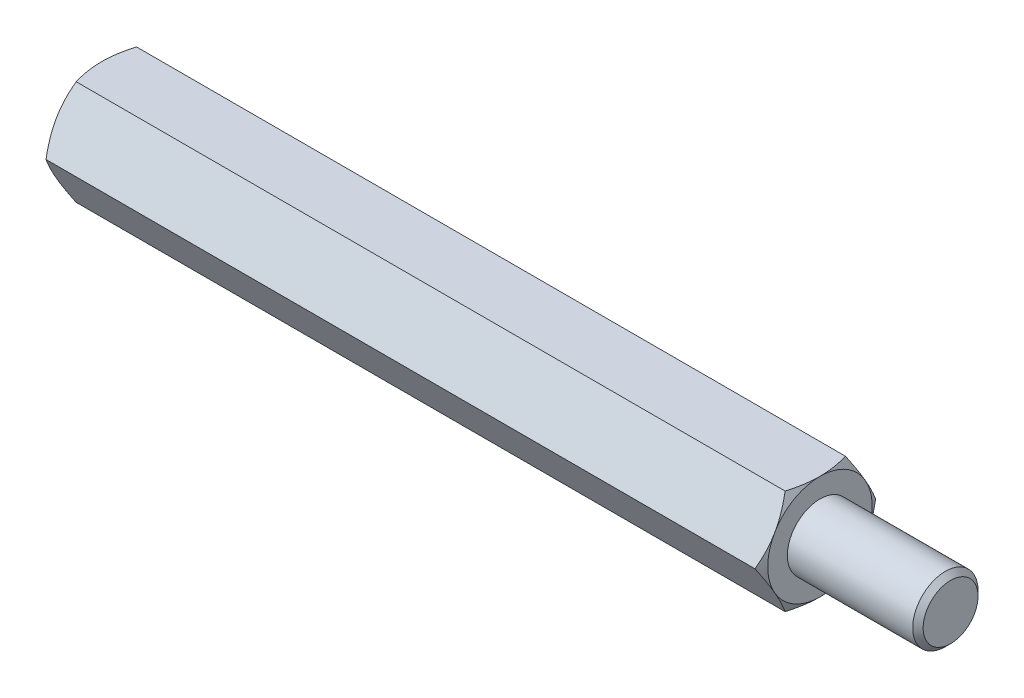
from build123d import *

# Parameters (mm, degrees)
EXTRUDE2_DEPTH = 27.5
SKETCH3_R      = 2.1
EXTRUDE3_DEPTH = 10
SKETCH5_R      = 2.5
EXTRUDE4_DEPTH = 10
CHAMFER1_SIZE  = 0.4


with BuildPart() as part:
    # Sketch1 → Extrude2 (new, symmetric)
    with BuildSketch(Plane(origin=(0, 0, 0), x_dir=(0, 0, -1), z_dir=(1, 0, 0))):
        Polygon((2.309401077, 4), (-2.309401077, 4), (-4.618802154, 0), (-2.309401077, -4), (2.309401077, -4), (4.618802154, 0), align=None)
    extrude(amount=EXTRUDE2_DEPTH, both=True)

    # Sketch2 → Cut-Revolve1 (revolve, cut)
    with BuildSketch(Plane.XY):
        with BuildLine():
            Line((-27.5, 4), (-26, 6.598076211))
            ThreePointArc((-26, 6.598076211), (-26.48810136, 7.776457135), (-27.5, 7))
            Line((-27.5, 7), (-27.5, 4))
        make_face()
    cut_revolve1 = revolve(axis=Axis((0, 0, 0), (1, 0, 0)), mode=Mode.SUBTRACT)

    # Mirror1: Cut-Revolve1 across plane
    add(cut_revolve1.mirror(Plane(origin=(0, 0, 0), x_dir=(0, 0, 1), z_dir=(1, 0, 0))), mode=Mode.SUBTRACT)

    # Sketch3 → Extrude3 (cut)
    with BuildSketch(Plane.ZY.offset(27.5)):
        Circle(SKETCH3_R)
    extrude(amount=-EXTRUDE3_DEPTH, mode=Mode.SUBTRACT)

    # Sketch4 → Cut-Revolve2 (revolve, cut)
    with BuildSketch(Plane.XY, mode=Mode.PRIVATE) as cut_revolve2_sk:
        Polygon((-17.5, 0), (-17.5, 2.1), (-16.287564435, 0), align=None)
    revolve(cut_revolve2_sk.sketch.rotate(Axis((-16.287564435, 0, 0), (-1, 0, 0)), 270), axis=Axis((-16.287564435, 0, 0), (-1, 0, 0)), mode=Mode.SUBTRACT)

    # Sketch5 → Extrude4 (add)
    with BuildSketch(Plane(origin=(27.5, 0, 0), x_dir=(0, 0, -1), z_dir=(1, 0, 0))):
        Circle(SKETCH5_R)
    extrude(amount=EXTRUDE4_DEPTH)

    # Chamfer1
    chamfer1_edges = [part.edges().sort_by_distance(p)[0] for p in [
        (37.5, 0, 2.5),
    ]]
    chamfer(chamfer1_edges, length=CHAMFER1_SIZE)


solid = part.part
